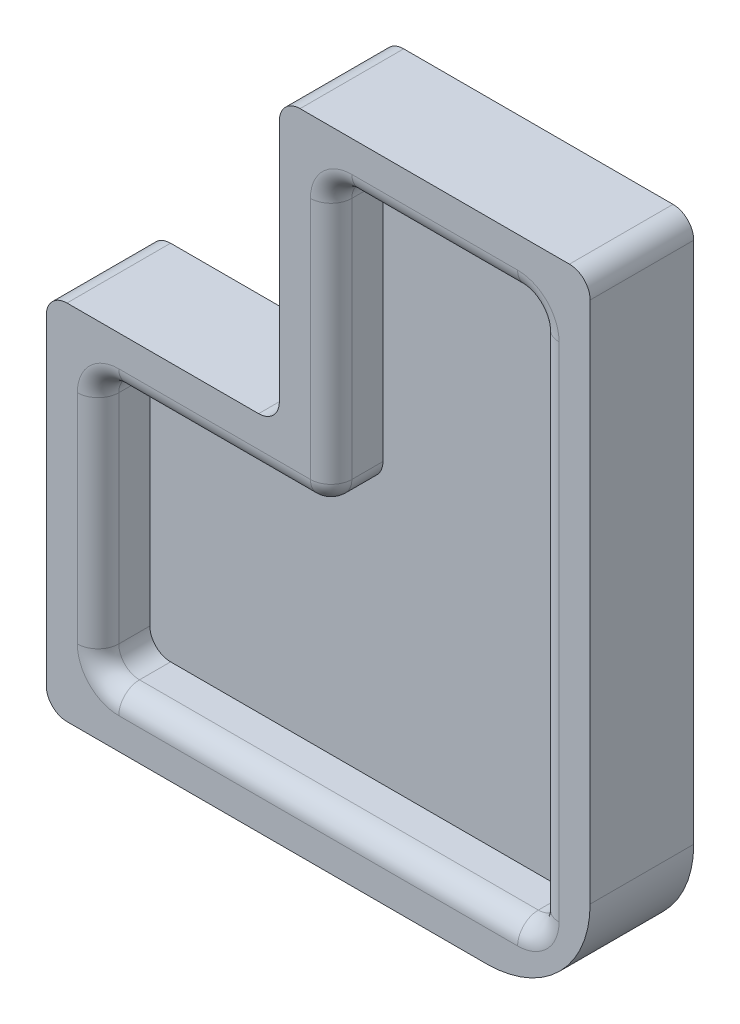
ISO-10303-21;
HEADER;
FILE_DESCRIPTION(('STEP AP214'),'2;1');
FILE_NAME('part.step','',(''),(''),'','','');
FILE_SCHEMA(('AUTOMOTIVE_DESIGN { 1 0 10303 214 1 1 1 1 }'));
ENDSEC;
DATA;
#1=APPLICATION_CONTEXT('core data for automotive mechanical design processes');
#2=APPLICATION_PROTOCOL_DEFINITION('international standard','automotive_design',2000,#1);
#3=PRODUCT_CONTEXT('',#1,'mechanical');
#4=PRODUCT('Part','Part','',(#3));
#5=PRODUCT_RELATED_PRODUCT_CATEGORY('part','',(#4));
#6=PRODUCT_DEFINITION_FORMATION('','',#4);
#7=PRODUCT_DEFINITION_CONTEXT('part definition',#1,'design');
#8=PRODUCT_DEFINITION('design','',#6,#7);
#9=PRODUCT_DEFINITION_SHAPE('','',#8);
#10=(LENGTH_UNIT() NAMED_UNIT(*) SI_UNIT(.MILLI.,.METRE.));
#11=(NAMED_UNIT(*) PLANE_ANGLE_UNIT() SI_UNIT($,.RADIAN.));
#12=(NAMED_UNIT(*) SI_UNIT($,.STERADIAN.) SOLID_ANGLE_UNIT());
#13=UNCERTAINTY_MEASURE_WITH_UNIT(LENGTH_MEASURE(1.E-05),#10,'distance_accuracy_value','');
#14=(GEOMETRIC_REPRESENTATION_CONTEXT(3) GLOBAL_UNCERTAINTY_ASSIGNED_CONTEXT((#13)) GLOBAL_UNIT_ASSIGNED_CONTEXT((#10,
#11,#12)) REPRESENTATION_CONTEXT('',''));
#15=CARTESIAN_POINT('',(0.,0.,0.));
#16=DIRECTION('',(0.,0.,1.));
#17=DIRECTION('',(1.,0.,0.));
#18=AXIS2_PLACEMENT_3D('',#15,#16,#17);
#19=CARTESIAN_POINT('',(91.,111.,16.));
#20=DIRECTION('',(0.,0.,-1.));
#21=DIRECTION('',(-1.,0.,0.));
#22=AXIS2_PLACEMENT_3D('',#19,#20,#21);
#23=TOROIDAL_SURFACE('',#22,8.,4.);
#24=CARTESIAN_POINT('',(99.,111.,16.));
#25=DIRECTION('',(0.,1.,0.));
#26=DIRECTION('',(0.,0.,1.));
#27=AXIS2_PLACEMENT_3D('',#24,#25,#26);
#28=CIRCLE('',#27,4.);
#29=CARTESIAN_POINT('',(95.,111.,16.));
#30=VERTEX_POINT('',#29);
#31=CARTESIAN_POINT('',(99.,111.,20.));
#32=VERTEX_POINT('',#31);
#33=EDGE_CURVE('E359',#30,#32,#28,.T.);
#34=ORIENTED_EDGE('',*,*,#33,.T.);
#35=CARTESIAN_POINT('',(91.,111.,20.));
#36=DIRECTION('',(0.,0.,-1.));
#37=DIRECTION('',(-1.,0.,0.));
#38=AXIS2_PLACEMENT_3D('',#35,#36,#37);
#39=CIRCLE('',#38,8.);
#40=CARTESIAN_POINT('',(91.,119.,20.));
#41=VERTEX_POINT('',#40);
#42=EDGE_CURVE('E356',#41,#32,#39,.T.);
#43=ORIENTED_EDGE('',*,*,#42,.F.);
#44=CARTESIAN_POINT('',(91.,119.,16.));
#45=DIRECTION('',(-1.,0.,0.));
#46=DIRECTION('',(0.,0.,1.));
#47=AXIS2_PLACEMENT_3D('',#44,#45,#46);
#48=CIRCLE('',#47,4.);
#49=CARTESIAN_POINT('',(91.,115.,16.));
#50=VERTEX_POINT('',#49);
#51=EDGE_CURVE('E362',#50,#41,#48,.T.);
#52=ORIENTED_EDGE('',*,*,#51,.F.);
#53=CARTESIAN_POINT('',(91.,111.,16.));
#54=DIRECTION('',(0.,0.,-1.));
#55=DIRECTION('',(-1.,0.,0.));
#56=AXIS2_PLACEMENT_3D('',#53,#54,#55);
#57=CIRCLE('',#56,4.);
#58=EDGE_CURVE('E353',#30,#50,#57,.F.);
#59=ORIENTED_EDGE('',*,*,#58,.F.);
#60=EDGE_LOOP('',(#34,#43,#52,#59));
#61=FACE_BOUND('',#60,.T.);
#62=ADVANCED_FACE('F35',(#61),#23,.T.);
#63=CARTESIAN_POINT('',(91.,14.,10.));
#64=DIRECTION('',(0.,0.,-1.));
#65=DIRECTION('',(-1.,0.,0.));
#66=AXIS2_PLACEMENT_3D('',#63,#64,#65);
#67=CYLINDRICAL_SURFACE('',#66,4.);
#68=DIRECTION('',(0.,0.,1.));
#69=VECTOR('',#68,1.);
#70=CARTESIAN_POINT('',(91.,10.,10.));
#71=LINE('',#70,#69);
#72=CARTESIAN_POINT('',(91.,10.,16.));
#73=VERTEX_POINT('',#72);
#74=CARTESIAN_POINT('',(91.,10.,10.));
#75=VERTEX_POINT('',#74);
#76=EDGE_CURVE('E306',#73,#75,#71,.F.);
#77=ORIENTED_EDGE('',*,*,#76,.F.);
#78=CARTESIAN_POINT('',(91.,14.,16.));
#79=DIRECTION('',(0.,0.,-1.));
#80=DIRECTION('',(-1.,0.,0.));
#81=AXIS2_PLACEMENT_3D('',#78,#79,#80);
#82=CIRCLE('',#81,4.);
#83=CARTESIAN_POINT('',(95.,14.,16.));
#84=VERTEX_POINT('',#83);
#85=EDGE_CURVE('E341',#73,#84,#82,.F.);
#86=ORIENTED_EDGE('',*,*,#85,.T.);
#87=DIRECTION('',(0.,0.,1.));
#88=VECTOR('',#87,1.);
#89=CARTESIAN_POINT('',(95.,14.,16.));
#90=LINE('',#89,#88);
#91=CARTESIAN_POINT('',(95.,14.,10.));
#92=VERTEX_POINT('',#91);
#93=EDGE_CURVE('E298',#92,#84,#90,.T.);
#94=ORIENTED_EDGE('',*,*,#93,.F.);
#95=CARTESIAN_POINT('',(91.,14.,10.));
#96=DIRECTION('',(0.,0.,1.));
#97=DIRECTION('',(1.,0.,0.));
#98=AXIS2_PLACEMENT_3D('',#95,#96,#97);
#99=CIRCLE('',#98,4.);
#100=EDGE_CURVE('E280',#75,#92,#99,.T.);
#101=ORIENTED_EDGE('',*,*,#100,.F.);
#102=EDGE_LOOP('',(#77,#86,#94,#101));
#103=FACE_BOUND('',#102,.T.);
#104=ADVANCED_FACE('F582',(#103),#67,.F.);
#105=CARTESIAN_POINT('',(10.,6.,16.));
#106=DIRECTION('',(1.,0.,0.));
#107=DIRECTION('',(0.,0.,-1.));
#108=AXIS2_PLACEMENT_3D('',#105,#106,#107);
#109=CYLINDRICAL_SURFACE('',#108,4.);
#110=DIRECTION('',(1.,0.,0.));
#111=VECTOR('',#110,1.);
#112=CARTESIAN_POINT('',(0.,6.,20.));
#113=LINE('',#112,#111);
#114=CARTESIAN_POINT('',(91.,6.,20.));
#115=VERTEX_POINT('',#114);
#116=CARTESIAN_POINT('',(14.,6.,20.));
#117=VERTEX_POINT('',#116);
#118=EDGE_CURVE('E241',#115,#117,#113,.F.);
#119=ORIENTED_EDGE('',*,*,#118,.F.);
#120=CARTESIAN_POINT('',(91.,6.,16.));
#121=DIRECTION('',(1.,0.,0.));
#122=DIRECTION('',(0.,0.,-1.));
#123=AXIS2_PLACEMENT_3D('',#120,#121,#122);
#124=CIRCLE('',#123,4.);
#125=EDGE_CURVE('E347',#73,#115,#124,.T.);
#126=ORIENTED_EDGE('',*,*,#125,.F.);
#127=DIRECTION('',(1.,0.,0.));
#128=VECTOR('',#127,1.);
#129=CARTESIAN_POINT('',(10.,10.,16.));
#130=LINE('',#129,#128);
#131=CARTESIAN_POINT('',(14.,10.,16.));
#132=VERTEX_POINT('',#131);
#133=EDGE_CURVE('E475',#132,#73,#130,.T.);
#134=ORIENTED_EDGE('',*,*,#133,.F.);
#135=CARTESIAN_POINT('',(14.,6.,16.));
#136=DIRECTION('',(1.,0.,0.));
#137=DIRECTION('',(0.,0.,-1.));
#138=AXIS2_PLACEMENT_3D('',#135,#136,#137);
#139=CIRCLE('',#138,4.);
#140=EDGE_CURVE('E338',#132,#117,#139,.T.);
#141=ORIENTED_EDGE('',*,*,#140,.T.);
#142=EDGE_LOOP('',(#119,#126,#134,#141));
#143=FACE_BOUND('',#142,.T.);
#144=ADVANCED_FACE('F495',(#143),#109,.T.);
#145=CARTESIAN_POINT('',(10.,10.,10.));
#146=DIRECTION('',(0.,-1.,0.));
#147=DIRECTION('',(0.,0.,-1.));
#148=AXIS2_PLACEMENT_3D('',#145,#146,#147);
#149=PLANE('',#148);
#150=ORIENTED_EDGE('',*,*,#133,.T.);
#151=ORIENTED_EDGE('',*,*,#76,.T.);
#152=DIRECTION('',(1.,0.,0.));
#153=VECTOR('',#152,1.);
#154=CARTESIAN_POINT('',(10.,10.,10.));
#155=LINE('',#154,#153);
#156=CARTESIAN_POINT('',(14.,10.,10.));
#157=VERTEX_POINT('',#156);
#158=EDGE_CURVE('E503',#157,#75,#155,.T.);
#159=ORIENTED_EDGE('',*,*,#158,.F.);
#160=DIRECTION('',(0.,0.,1.));
#161=VECTOR('',#160,1.);
#162=CARTESIAN_POINT('',(14.,10.,16.));
#163=LINE('',#162,#161);
#164=EDGE_CURVE('E303',#157,#132,#163,.T.);
#165=ORIENTED_EDGE('',*,*,#164,.T.);
#166=EDGE_LOOP('',(#150,#151,#159,#165));
#167=FACE_BOUND('',#166,.T.);
#168=ADVANCED_FACE('F501',(#167),#149,.F.);
#169=CARTESIAN_POINT('',(14.,14.,16.));
#170=DIRECTION('',(0.,0.,-1.));
#171=DIRECTION('',(-1.,0.,0.));
#172=AXIS2_PLACEMENT_3D('',#169,#170,#171);
#173=TOROIDAL_SURFACE('',#172,8.,4.);
#174=CARTESIAN_POINT('',(6.,14.,16.));
#175=DIRECTION('',(0.,-1.,0.));
#176=DIRECTION('',(0.,0.,-1.));
#177=AXIS2_PLACEMENT_3D('',#174,#175,#176);
#178=CIRCLE('',#177,4.);
#179=CARTESIAN_POINT('',(10.,14.,16.));
#180=VERTEX_POINT('',#179);
#181=CARTESIAN_POINT('',(6.,14.,20.));
#182=VERTEX_POINT('',#181);
#183=EDGE_CURVE('E335',#180,#182,#178,.T.);
#184=ORIENTED_EDGE('',*,*,#183,.T.);
#185=CARTESIAN_POINT('',(14.,14.,20.));
#186=DIRECTION('',(0.,0.,-1.));
#187=DIRECTION('',(-1.,0.,0.));
#188=AXIS2_PLACEMENT_3D('',#185,#186,#187);
#189=CIRCLE('',#188,8.);
#190=EDGE_CURVE('E332',#117,#182,#189,.T.);
#191=ORIENTED_EDGE('',*,*,#190,.F.);
#192=ORIENTED_EDGE('',*,*,#140,.F.);
#193=CARTESIAN_POINT('',(14.,14.,16.));
#194=DIRECTION('',(0.,0.,-1.));
#195=DIRECTION('',(-1.,0.,0.));
#196=AXIS2_PLACEMENT_3D('',#193,#194,#195);
#197=CIRCLE('',#196,4.);
#198=EDGE_CURVE('E329',#180,#132,#197,.F.);
#199=ORIENTED_EDGE('',*,*,#198,.F.);
#200=EDGE_LOOP('',(#184,#191,#192,#199));
#201=FACE_BOUND('',#200,.T.);
#202=ADVANCED_FACE('F493',(#201),#173,.T.);
#203=CARTESIAN_POINT('',(51.,115.,16.));
#204=DIRECTION('',(0.,-1.,0.));
#205=DIRECTION('',(0.,0.,-1.));
#206=AXIS2_PLACEMENT_3D('',#203,#204,#205);
#207=CYLINDRICAL_SURFACE('',#206,4.);
#208=DIRECTION('',(0.,-1.,0.));
#209=VECTOR('',#208,1.);
#210=CARTESIAN_POINT('',(55.,115.,16.));
#211=LINE('',#210,#209);
#212=CARTESIAN_POINT('',(55.,111.,16.));
#213=VERTEX_POINT('',#212);
#214=CARTESIAN_POINT('',(55.,64.,16.));
#215=VERTEX_POINT('',#214);
#216=EDGE_CURVE('E472',#213,#215,#211,.T.);
#217=ORIENTED_EDGE('',*,*,#216,.F.);
#218=CARTESIAN_POINT('',(51.,111.,16.));
#219=DIRECTION('',(0.,-1.,0.));
#220=DIRECTION('',(0.,0.,-1.));
#221=AXIS2_PLACEMENT_3D('',#218,#219,#220);
#222=CIRCLE('',#221,4.);
#223=CARTESIAN_POINT('',(51.,111.,20.));
#224=VERTEX_POINT('',#223);
#225=EDGE_CURVE('E260',#213,#224,#222,.T.);
#226=ORIENTED_EDGE('',*,*,#225,.T.);
#227=DIRECTION('',(0.,-1.,0.));
#228=VECTOR('',#227,1.);
#229=CARTESIAN_POINT('',(51.,0.,20.));
#230=LINE('',#229,#228);
#231=CARTESIAN_POINT('',(51.,64.,20.));
#232=VERTEX_POINT('',#231);
#233=EDGE_CURVE('E234',#232,#224,#230,.F.);
#234=ORIENTED_EDGE('',*,*,#233,.F.);
#235=CARTESIAN_POINT('',(51.,64.,16.));
#236=DIRECTION('',(0.,-1.,0.));
#237=DIRECTION('',(0.,0.,-1.));
#238=AXIS2_PLACEMENT_3D('',#235,#236,#237);
#239=CIRCLE('',#238,4.);
#240=EDGE_CURVE('E252',#232,#215,#239,.F.);
#241=ORIENTED_EDGE('',*,*,#240,.T.);
#242=EDGE_LOOP('',(#217,#226,#234,#241));
#243=FACE_BOUND('',#242,.T.);
#244=ADVANCED_FACE('F258',(#243),#207,.T.);
#245=CARTESIAN_POINT('',(59.,111.,10.));
#246=DIRECTION('',(0.,0.,-1.));
#247=DIRECTION('',(-1.,0.,0.));
#248=AXIS2_PLACEMENT_3D('',#245,#246,#247);
#249=CYLINDRICAL_SURFACE('',#248,4.);
#250=DIRECTION('',(0.,0.,1.));
#251=VECTOR('',#250,1.);
#252=CARTESIAN_POINT('',(59.,115.,10.));
#253=LINE('',#252,#251);
#254=CARTESIAN_POINT('',(59.,115.,16.));
#255=VERTEX_POINT('',#254);
#256=CARTESIAN_POINT('',(59.,115.,10.));
#257=VERTEX_POINT('',#256);
#258=EDGE_CURVE('E296',#255,#257,#253,.F.);
#259=ORIENTED_EDGE('',*,*,#258,.F.);
#260=CARTESIAN_POINT('',(59.,111.,16.));
#261=DIRECTION('',(0.,0.,-1.));
#262=DIRECTION('',(-1.,0.,0.));
#263=AXIS2_PLACEMENT_3D('',#260,#261,#262);
#264=CIRCLE('',#263,4.);
#265=EDGE_CURVE('E321',#255,#213,#264,.F.);
#266=ORIENTED_EDGE('',*,*,#265,.T.);
#267=DIRECTION('',(0.,0.,1.));
#268=VECTOR('',#267,1.);
#269=CARTESIAN_POINT('',(55.,111.,16.));
#270=LINE('',#269,#268);
#271=CARTESIAN_POINT('',(55.,111.,10.));
#272=VERTEX_POINT('',#271);
#273=EDGE_CURVE('E290',#272,#213,#270,.T.);
#274=ORIENTED_EDGE('',*,*,#273,.F.);
#275=CARTESIAN_POINT('',(59.,111.,10.));
#276=DIRECTION('',(0.,0.,1.));
#277=DIRECTION('',(1.,0.,0.));
#278=AXIS2_PLACEMENT_3D('',#275,#276,#277);
#279=CIRCLE('',#278,4.);
#280=EDGE_CURVE('E284',#257,#272,#279,.T.);
#281=ORIENTED_EDGE('',*,*,#280,.F.);
#282=EDGE_LOOP('',(#259,#266,#274,#281));
#283=FACE_BOUND('',#282,.T.);
#284=ADVANCED_FACE('F585',(#283),#249,.F.);
#285=CARTESIAN_POINT('',(55.,115.,10.));
#286=DIRECTION('',(-1.,0.,0.));
#287=DIRECTION('',(0.,0.,1.));
#288=AXIS2_PLACEMENT_3D('',#285,#286,#287);
#289=PLANE('',#288);
#290=ORIENTED_EDGE('',*,*,#273,.T.);
#291=ORIENTED_EDGE('',*,*,#216,.T.);
#292=DIRECTION('',(0.,0.,1.));
#293=VECTOR('',#292,1.);
#294=CARTESIAN_POINT('',(55.,64.,10.));
#295=LINE('',#294,#293);
#296=CARTESIAN_POINT('',(55.,64.,10.));
#297=VERTEX_POINT('',#296);
#298=EDGE_CURVE('E288',#215,#297,#295,.F.);
#299=ORIENTED_EDGE('',*,*,#298,.T.);
#300=DIRECTION('',(0.,-1.,0.));
#301=VECTOR('',#300,1.);
#302=CARTESIAN_POINT('',(55.,115.,10.));
#303=LINE('',#302,#301);
#304=EDGE_CURVE('E515',#272,#297,#303,.T.);
#305=ORIENTED_EDGE('',*,*,#304,.F.);
#306=EDGE_LOOP('',(#290,#291,#299,#305));
#307=FACE_BOUND('',#306,.T.);
#308=ADVANCED_FACE('F596',(#307),#289,.F.);
#309=CARTESIAN_POINT('',(14.,56.,16.));
#310=DIRECTION('',(0.,0.,-1.));
#311=DIRECTION('',(-1.,0.,0.));
#312=AXIS2_PLACEMENT_3D('',#309,#310,#311);
#313=TOROIDAL_SURFACE('',#312,8.,4.);
#314=CARTESIAN_POINT('',(14.,64.,16.));
#315=DIRECTION('',(-1.,0.,0.));
#316=DIRECTION('',(0.,0.,1.));
#317=AXIS2_PLACEMENT_3D('',#314,#315,#316);
#318=CIRCLE('',#317,4.);
#319=CARTESIAN_POINT('',(14.,60.,16.));
#320=VERTEX_POINT('',#319);
#321=CARTESIAN_POINT('',(14.,64.,20.));
#322=VERTEX_POINT('',#321);
#323=EDGE_CURVE('E315',#320,#322,#318,.T.);
#324=ORIENTED_EDGE('',*,*,#323,.T.);
#325=CARTESIAN_POINT('',(14.,56.,20.));
#326=DIRECTION('',(0.,0.,-1.));
#327=DIRECTION('',(-1.,0.,0.));
#328=AXIS2_PLACEMENT_3D('',#325,#326,#327);
#329=CIRCLE('',#328,8.);
#330=CARTESIAN_POINT('',(6.,56.,20.));
#331=VERTEX_POINT('',#330);
#332=EDGE_CURVE('E237',#331,#322,#329,.T.);
#333=ORIENTED_EDGE('',*,*,#332,.F.);
#334=CARTESIAN_POINT('',(6.,56.,16.));
#335=DIRECTION('',(0.,-1.,0.));
#336=DIRECTION('',(0.,0.,-1.));
#337=AXIS2_PLACEMENT_3D('',#334,#335,#336);
#338=CIRCLE('',#337,4.);
#339=CARTESIAN_POINT('',(10.,56.,16.));
#340=VERTEX_POINT('',#339);
#341=EDGE_CURVE('E318',#340,#331,#338,.T.);
#342=ORIENTED_EDGE('',*,*,#341,.F.);
#343=CARTESIAN_POINT('',(14.,56.,16.));
#344=DIRECTION('',(0.,0.,-1.));
#345=DIRECTION('',(-1.,0.,0.));
#346=AXIS2_PLACEMENT_3D('',#343,#344,#345);
#347=CIRCLE('',#346,4.);
#348=EDGE_CURVE('E313',#320,#340,#347,.F.);
#349=ORIENTED_EDGE('',*,*,#348,.F.);
#350=EDGE_LOOP('',(#324,#333,#342,#349));
#351=FACE_BOUND('',#350,.T.);
#352=ADVANCED_FACE('F613',(#351),#313,.T.);
#353=CARTESIAN_POINT('',(51.,64.,16.));
#354=DIRECTION('',(0.,0.,1.));
#355=DIRECTION('',(1.,0.,0.));
#356=AXIS2_PLACEMENT_3D('',#353,#354,#355);
#357=SPHERICAL_SURFACE('',#356,4.);
#358=ORIENTED_EDGE('',*,*,#240,.F.);
#359=CARTESIAN_POINT('',(51.,64.,16.));
#360=DIRECTION('',(-1.,0.,0.));
#361=DIRECTION('',(0.,0.,1.));
#362=AXIS2_PLACEMENT_3D('',#359,#360,#361);
#363=CIRCLE('',#362,4.);
#364=CARTESIAN_POINT('',(51.,60.,16.));
#365=VERTEX_POINT('',#364);
#366=EDGE_CURVE('E245',#365,#232,#363,.T.);
#367=ORIENTED_EDGE('',*,*,#366,.F.);
#368=CARTESIAN_POINT('',(51.,64.,16.));
#369=DIRECTION('',(0.,0.,1.));
#370=DIRECTION('',(1.,0.,0.));
#371=AXIS2_PLACEMENT_3D('',#368,#369,#370);
#372=CIRCLE('',#371,4.);
#373=EDGE_CURVE('E264',#365,#215,#372,.T.);
#374=ORIENTED_EDGE('',*,*,#373,.T.);
#375=EDGE_LOOP('',(#358,#367,#374));
#376=FACE_BOUND('',#375,.T.);
#377=ADVANCED_FACE('F263',(#376),#357,.T.);
#378=CARTESIAN_POINT('',(51.,64.,10.));
#379=DIRECTION('',(0.,0.,1.));
#380=DIRECTION('',(1.,0.,0.));
#381=AXIS2_PLACEMENT_3D('',#378,#379,#380);
#382=CYLINDRICAL_SURFACE('',#381,4.);
#383=CARTESIAN_POINT('',(51.,64.,10.));
#384=DIRECTION('',(0.,0.,1.));
#385=DIRECTION('',(1.,0.,0.));
#386=AXIS2_PLACEMENT_3D('',#383,#384,#385);
#387=CIRCLE('',#386,4.);
#388=CARTESIAN_POINT('',(51.,60.,10.));
#389=VERTEX_POINT('',#388);
#390=EDGE_CURVE('E308',#297,#389,#387,.F.);
#391=ORIENTED_EDGE('',*,*,#390,.F.);
#392=ORIENTED_EDGE('',*,*,#298,.F.);
#393=ORIENTED_EDGE('',*,*,#373,.F.);
#394=DIRECTION('',(0.,0.,1.));
#395=VECTOR('',#394,1.);
#396=CARTESIAN_POINT('',(51.,60.,10.));
#397=LINE('',#396,#395);
#398=EDGE_CURVE('E274',#389,#365,#397,.T.);
#399=ORIENTED_EDGE('',*,*,#398,.F.);
#400=EDGE_LOOP('',(#391,#392,#393,#399));
#401=FACE_BOUND('',#400,.T.);
#402=ADVANCED_FACE('F612',(#401),#382,.T.);
#403=CARTESIAN_POINT('',(0.,0.,10.));
#404=DIRECTION('',(0.,0.,1.));
#405=DIRECTION('',(1.,0.,0.));
#406=AXIS2_PLACEMENT_3D('',#403,#404,#405);
#407=PLANE('',#406);
#408=DIRECTION('',(-1.,0.,0.));
#409=VECTOR('',#408,1.);
#410=CARTESIAN_POINT('',(55.,60.,10.));
#411=LINE('',#410,#409);
#412=CARTESIAN_POINT('',(14.,60.,10.));
#413=VERTEX_POINT('',#412);
#414=EDGE_CURVE('E454',#389,#413,#411,.T.);
#415=ORIENTED_EDGE('',*,*,#414,.T.);
#416=CARTESIAN_POINT('',(14.,56.,10.));
#417=DIRECTION('',(0.,0.,1.));
#418=DIRECTION('',(1.,0.,0.));
#419=AXIS2_PLACEMENT_3D('',#416,#417,#418);
#420=CIRCLE('',#419,4.);
#421=CARTESIAN_POINT('',(10.,56.,10.));
#422=VERTEX_POINT('',#421);
#423=EDGE_CURVE('E286',#413,#422,#420,.T.);
#424=ORIENTED_EDGE('',*,*,#423,.T.);
#425=DIRECTION('',(0.,-1.,0.));
#426=VECTOR('',#425,1.);
#427=CARTESIAN_POINT('',(10.,60.,10.));
#428=LINE('',#427,#426);
#429=CARTESIAN_POINT('',(10.,14.,10.));
#430=VERTEX_POINT('',#429);
#431=EDGE_CURVE('E312',#422,#430,#428,.T.);
#432=ORIENTED_EDGE('',*,*,#431,.T.);
#433=CARTESIAN_POINT('',(14.,14.,10.));
#434=DIRECTION('',(0.,0.,1.));
#435=DIRECTION('',(1.,0.,0.));
#436=AXIS2_PLACEMENT_3D('',#433,#434,#435);
#437=CIRCLE('',#436,4.);
#438=EDGE_CURVE('E278',#430,#157,#437,.T.);
#439=ORIENTED_EDGE('',*,*,#438,.T.);
#440=ORIENTED_EDGE('',*,*,#158,.T.);
#441=ORIENTED_EDGE('',*,*,#100,.T.);
#442=DIRECTION('',(0.,1.,0.));
#443=VECTOR('',#442,1.);
#444=CARTESIAN_POINT('',(95.,10.,10.));
#445=LINE('',#444,#443);
#446=CARTESIAN_POINT('',(95.,111.,10.));
#447=VERTEX_POINT('',#446);
#448=EDGE_CURVE('E506',#92,#447,#445,.T.);
#449=ORIENTED_EDGE('',*,*,#448,.T.);
#450=CARTESIAN_POINT('',(91.,111.,10.));
#451=DIRECTION('',(0.,0.,1.));
#452=DIRECTION('',(1.,0.,0.));
#453=AXIS2_PLACEMENT_3D('',#450,#451,#452);
#454=CIRCLE('',#453,4.);
#455=CARTESIAN_POINT('',(91.,115.,10.));
#456=VERTEX_POINT('',#455);
#457=EDGE_CURVE('E282',#447,#456,#454,.T.);
#458=ORIENTED_EDGE('',*,*,#457,.T.);
#459=DIRECTION('',(-1.,0.,0.));
#460=VECTOR('',#459,1.);
#461=CARTESIAN_POINT('',(95.,115.,10.));
#462=LINE('',#461,#460);
#463=EDGE_CURVE('E509',#456,#257,#462,.T.);
#464=ORIENTED_EDGE('',*,*,#463,.T.);
#465=ORIENTED_EDGE('',*,*,#280,.T.);
#466=ORIENTED_EDGE('',*,*,#304,.T.);
#467=ORIENTED_EDGE('',*,*,#390,.T.);
#468=EDGE_LOOP('',(#415,#424,#432,#439,#440,#441,#449,#458,#464,#465,#466,#467));
#469=FACE_BOUND('',#468,.T.);
#470=ADVANCED_FACE('F616',(#469),#407,.T.);
#471=CARTESIAN_POINT('',(0.,0.,0.));
#472=DIRECTION('',(0.,0.,-1.));
#473=DIRECTION('',(-1.,0.,0.));
#474=AXIS2_PLACEMENT_3D('',#471,#472,#473);
#475=PLANE('',#474);
#476=DIRECTION('',(-1.,0.,0.));
#477=VECTOR('',#476,1.);
#478=CARTESIAN_POINT('',(45.,125.,0.));
#479=LINE('',#478,#477);
#480=CARTESIAN_POINT('',(101.,125.,0.));
#481=VERTEX_POINT('',#480);
#482=CARTESIAN_POINT('',(49.,125.,0.));
#483=VERTEX_POINT('',#482);
#484=EDGE_CURVE('E432',#481,#483,#479,.T.);
#485=ORIENTED_EDGE('',*,*,#484,.F.);
#486=CARTESIAN_POINT('',(101.,121.,0.));
#487=DIRECTION('',(0.,0.,-1.));
#488=DIRECTION('',(-1.,0.,0.));
#489=AXIS2_PLACEMENT_3D('',#486,#487,#488);
#490=CIRCLE('',#489,4.);
#491=CARTESIAN_POINT('',(105.,121.,0.));
#492=VERTEX_POINT('',#491);
#493=EDGE_CURVE('E388',#481,#492,#490,.T.);
#494=ORIENTED_EDGE('',*,*,#493,.T.);
#495=DIRECTION('',(0.,1.,0.));
#496=VECTOR('',#495,1.);
#497=CARTESIAN_POINT('',(105.,125.,0.));
#498=LINE('',#497,#496);
#499=CARTESIAN_POINT('',(105.,20.,0.));
#500=VERTEX_POINT('',#499);
#501=EDGE_CURVE('E453',#500,#492,#498,.T.);
#502=ORIENTED_EDGE('',*,*,#501,.F.);
#503=CARTESIAN_POINT('',(85.,20.,0.));
#504=DIRECTION('',(0.,0.,-1.));
#505=DIRECTION('',(-1.,0.,0.));
#506=AXIS2_PLACEMENT_3D('',#503,#504,#505);
#507=CIRCLE('',#506,20.);
#508=CARTESIAN_POINT('',(85.,0.,0.));
#509=VERTEX_POINT('',#508);
#510=EDGE_CURVE('E369',#500,#509,#507,.T.);
#511=ORIENTED_EDGE('',*,*,#510,.T.);
#512=DIRECTION('',(1.,0.,0.));
#513=VECTOR('',#512,1.);
#514=CARTESIAN_POINT('',(105.,0.,0.));
#515=LINE('',#514,#513);
#516=CARTESIAN_POINT('',(4.,0.,0.));
#517=VERTEX_POINT('',#516);
#518=EDGE_CURVE('E451',#517,#509,#515,.T.);
#519=ORIENTED_EDGE('',*,*,#518,.F.);
#520=CARTESIAN_POINT('',(4.,4.,0.));
#521=DIRECTION('',(0.,0.,-1.));
#522=DIRECTION('',(-1.,0.,0.));
#523=AXIS2_PLACEMENT_3D('',#520,#521,#522);
#524=CIRCLE('',#523,4.);
#525=CARTESIAN_POINT('',(0.,4.,0.));
#526=VERTEX_POINT('',#525);
#527=EDGE_CURVE('E382',#517,#526,#524,.T.);
#528=ORIENTED_EDGE('',*,*,#527,.T.);
#529=DIRECTION('',(0.,-1.,0.));
#530=VECTOR('',#529,1.);
#531=CARTESIAN_POINT('',(0.,0.,0.));
#532=LINE('',#531,#530);
#533=CARTESIAN_POINT('',(0.,66.,0.));
#534=VERTEX_POINT('',#533);
#535=EDGE_CURVE('E460',#534,#526,#532,.T.);
#536=ORIENTED_EDGE('',*,*,#535,.F.);
#537=CARTESIAN_POINT('',(4.,66.,0.));
#538=DIRECTION('',(0.,0.,-1.));
#539=DIRECTION('',(-1.,0.,0.));
#540=AXIS2_PLACEMENT_3D('',#537,#538,#539);
#541=CIRCLE('',#540,4.);
#542=CARTESIAN_POINT('',(4.,70.,0.));
#543=VERTEX_POINT('',#542);
#544=EDGE_CURVE('E386',#534,#543,#541,.T.);
#545=ORIENTED_EDGE('',*,*,#544,.T.);
#546=DIRECTION('',(-1.,0.,0.));
#547=VECTOR('',#546,1.);
#548=CARTESIAN_POINT('',(0.,70.,0.));
#549=LINE('',#548,#547);
#550=CARTESIAN_POINT('',(41.,70.,0.));
#551=VERTEX_POINT('',#550);
#552=EDGE_CURVE('E423',#551,#543,#549,.T.);
#553=ORIENTED_EDGE('',*,*,#552,.F.);
#554=CARTESIAN_POINT('',(41.,74.,0.));
#555=DIRECTION('',(0.,0.,-1.));
#556=DIRECTION('',(-1.,0.,0.));
#557=AXIS2_PLACEMENT_3D('',#554,#555,#556);
#558=CIRCLE('',#557,4.);
#559=CARTESIAN_POINT('',(45.,74.,0.));
#560=VERTEX_POINT('',#559);
#561=EDGE_CURVE('E43',#551,#560,#558,.F.);
#562=ORIENTED_EDGE('',*,*,#561,.T.);
#563=DIRECTION('',(0.,-1.,0.));
#564=VECTOR('',#563,1.);
#565=CARTESIAN_POINT('',(45.,70.,0.));
#566=LINE('',#565,#564);
#567=CARTESIAN_POINT('',(45.,121.,0.));
#568=VERTEX_POINT('',#567);
#569=EDGE_CURVE('E421',#568,#560,#566,.T.);
#570=ORIENTED_EDGE('',*,*,#569,.F.);
#571=CARTESIAN_POINT('',(49.,121.,0.));
#572=DIRECTION('',(0.,0.,-1.));
#573=DIRECTION('',(-1.,0.,0.));
#574=AXIS2_PLACEMENT_3D('',#571,#572,#573);
#575=CIRCLE('',#574,4.);
#576=EDGE_CURVE('E384',#568,#483,#575,.T.);
#577=ORIENTED_EDGE('',*,*,#576,.T.);
#578=EDGE_LOOP('',(#485,#494,#502,#511,#519,#528,#536,#545,#553,#562,#570,#577));
#579=FACE_BOUND('',#578,.T.);
#580=ADVANCED_FACE('F420',(#579),#475,.T.);
#581=CARTESIAN_POINT('',(0.,0.,20.));
#582=DIRECTION('',(1.,0.,0.));
#583=DIRECTION('',(0.,0.,-1.));
#584=AXIS2_PLACEMENT_3D('',#581,#582,#583);
#585=PLANE('',#584);
#586=DIRECTION('',(0.,-1.,0.));
#587=VECTOR('',#586,1.);
#588=CARTESIAN_POINT('',(0.,0.,20.));
#589=LINE('',#588,#587);
#590=CARTESIAN_POINT('',(0.,66.,20.));
#591=VERTEX_POINT('',#590);
#592=CARTESIAN_POINT('',(0.,4.,20.));
#593=VERTEX_POINT('',#592);
#594=EDGE_CURVE('E443',#591,#593,#589,.T.);
#595=ORIENTED_EDGE('',*,*,#594,.F.);
#596=DIRECTION('',(0.,0.,-1.));
#597=VECTOR('',#596,1.);
#598=CARTESIAN_POINT('',(0.,66.,20.));
#599=LINE('',#598,#597);
#600=EDGE_CURVE('E400',#591,#534,#599,.T.);
#601=ORIENTED_EDGE('',*,*,#600,.T.);
#602=ORIENTED_EDGE('',*,*,#535,.T.);
#603=DIRECTION('',(0.,0.,-1.));
#604=VECTOR('',#603,1.);
#605=CARTESIAN_POINT('',(0.,4.,20.));
#606=LINE('',#605,#604);
#607=EDGE_CURVE('E50',#526,#593,#606,.F.);
#608=ORIENTED_EDGE('',*,*,#607,.T.);
#609=EDGE_LOOP('',(#595,#601,#602,#608));
#610=FACE_BOUND('',#609,.T.);
#611=ADVANCED_FACE('F553',(#610),#585,.F.);
#612=CARTESIAN_POINT('',(0.,70.,20.));
#613=DIRECTION('',(0.,-1.,0.));
#614=DIRECTION('',(0.,0.,-1.));
#615=AXIS2_PLACEMENT_3D('',#612,#613,#614);
#616=PLANE('',#615);
#617=ORIENTED_EDGE('',*,*,#552,.T.);
#618=DIRECTION('',(0.,0.,-1.));
#619=VECTOR('',#618,1.);
#620=CARTESIAN_POINT('',(4.,70.,20.));
#621=LINE('',#620,#619);
#622=CARTESIAN_POINT('',(4.,70.,20.));
#623=VERTEX_POINT('',#622);
#624=EDGE_CURVE('E406',#543,#623,#621,.F.);
#625=ORIENTED_EDGE('',*,*,#624,.T.);
#626=DIRECTION('',(-1.,0.,0.));
#627=VECTOR('',#626,1.);
#628=CARTESIAN_POINT('',(0.,70.,20.));
#629=LINE('',#628,#627);
#630=CARTESIAN_POINT('',(41.,70.,20.));
#631=VERTEX_POINT('',#630);
#632=EDGE_CURVE('E438',#631,#623,#629,.T.);
#633=ORIENTED_EDGE('',*,*,#632,.F.);
#634=DIRECTION('',(0.,0.,-1.));
#635=VECTOR('',#634,1.);
#636=CARTESIAN_POINT('',(41.,70.,0.));
#637=LINE('',#636,#635);
#638=EDGE_CURVE('E403',#631,#551,#637,.T.);
#639=ORIENTED_EDGE('',*,*,#638,.T.);
#640=EDGE_LOOP('',(#617,#625,#633,#639));
#641=FACE_BOUND('',#640,.T.);
#642=ADVANCED_FACE('F441',(#641),#616,.F.);
#643=CARTESIAN_POINT('',(45.,70.,20.));
#644=DIRECTION('',(1.,0.,0.));
#645=DIRECTION('',(0.,0.,-1.));
#646=AXIS2_PLACEMENT_3D('',#643,#644,#645);
#647=PLANE('',#646);
#648=DIRECTION('',(0.,-1.,0.));
#649=VECTOR('',#648,1.);
#650=CARTESIAN_POINT('',(45.,70.,20.));
#651=LINE('',#650,#649);
#652=CARTESIAN_POINT('',(45.,121.,20.));
#653=VERTEX_POINT('',#652);
#654=CARTESIAN_POINT('',(45.,74.,20.));
#655=VERTEX_POINT('',#654);
#656=EDGE_CURVE('E439',#653,#655,#651,.T.);
#657=ORIENTED_EDGE('',*,*,#656,.F.);
#658=DIRECTION('',(0.,0.,-1.));
#659=VECTOR('',#658,1.);
#660=CARTESIAN_POINT('',(45.,121.,20.));
#661=LINE('',#660,#659);
#662=EDGE_CURVE('E410',#653,#568,#661,.T.);
#663=ORIENTED_EDGE('',*,*,#662,.T.);
#664=ORIENTED_EDGE('',*,*,#569,.T.);
#665=DIRECTION('',(0.,0.,-1.));
#666=VECTOR('',#665,1.);
#667=CARTESIAN_POINT('',(45.,74.,20.));
#668=LINE('',#667,#666);
#669=EDGE_CURVE('E408',#560,#655,#668,.F.);
#670=ORIENTED_EDGE('',*,*,#669,.T.);
#671=EDGE_LOOP('',(#657,#663,#664,#670));
#672=FACE_BOUND('',#671,.T.);
#673=ADVANCED_FACE('F429',(#672),#647,.F.);
#674=CARTESIAN_POINT('',(45.,125.,20.));
#675=DIRECTION('',(0.,-1.,0.));
#676=DIRECTION('',(0.,0.,-1.));
#677=AXIS2_PLACEMENT_3D('',#674,#675,#676);
#678=PLANE('',#677);
#679=DIRECTION('',(-1.,0.,0.));
#680=VECTOR('',#679,1.);
#681=CARTESIAN_POINT('',(45.,125.,20.));
#682=LINE('',#681,#680);
#683=CARTESIAN_POINT('',(101.,125.,20.));
#684=VERTEX_POINT('',#683);
#685=CARTESIAN_POINT('',(49.,125.,20.));
#686=VERTEX_POINT('',#685);
#687=EDGE_CURVE('E447',#684,#686,#682,.T.);
#688=ORIENTED_EDGE('',*,*,#687,.F.);
#689=DIRECTION('',(0.,0.,-1.));
#690=VECTOR('',#689,1.);
#691=CARTESIAN_POINT('',(101.,125.,20.));
#692=LINE('',#691,#690);
#693=EDGE_CURVE('E379',#684,#481,#692,.T.);
#694=ORIENTED_EDGE('',*,*,#693,.T.);
#695=ORIENTED_EDGE('',*,*,#484,.T.);
#696=DIRECTION('',(0.,0.,-1.));
#697=VECTOR('',#696,1.);
#698=CARTESIAN_POINT('',(49.,125.,20.));
#699=LINE('',#698,#697);
#700=EDGE_CURVE('E377',#483,#686,#699,.F.);
#701=ORIENTED_EDGE('',*,*,#700,.T.);
#702=EDGE_LOOP('',(#688,#694,#695,#701));
#703=FACE_BOUND('',#702,.T.);
#704=ADVANCED_FACE('F531',(#703),#678,.F.);
#705=CARTESIAN_POINT('',(105.,125.,20.));
#706=DIRECTION('',(-1.,0.,0.));
#707=DIRECTION('',(0.,0.,1.));
#708=AXIS2_PLACEMENT_3D('',#705,#706,#707);
#709=PLANE('',#708);
#710=ORIENTED_EDGE('',*,*,#501,.T.);
#711=DIRECTION('',(0.,0.,-1.));
#712=VECTOR('',#711,1.);
#713=CARTESIAN_POINT('',(105.,121.,20.));
#714=LINE('',#713,#712);
#715=CARTESIAN_POINT('',(105.,121.,20.));
#716=VERTEX_POINT('',#715);
#717=EDGE_CURVE('E390',#492,#716,#714,.F.);
#718=ORIENTED_EDGE('',*,*,#717,.T.);
#719=DIRECTION('',(0.,1.,0.));
#720=VECTOR('',#719,1.);
#721=CARTESIAN_POINT('',(105.,125.,20.));
#722=LINE('',#721,#720);
#723=CARTESIAN_POINT('',(105.,20.,20.));
#724=VERTEX_POINT('',#723);
#725=EDGE_CURVE('E521',#724,#716,#722,.T.);
#726=ORIENTED_EDGE('',*,*,#725,.F.);
#727=DIRECTION('',(0.,0.,-1.));
#728=VECTOR('',#727,1.);
#729=CARTESIAN_POINT('',(105.,20.,20.));
#730=LINE('',#729,#728);
#731=EDGE_CURVE('E310',#724,#500,#730,.T.);
#732=ORIENTED_EDGE('',*,*,#731,.T.);
#733=EDGE_LOOP('',(#710,#718,#726,#732));
#734=FACE_BOUND('',#733,.T.);
#735=ADVANCED_FACE('F537',(#734),#709,.F.);
#736=CARTESIAN_POINT('',(105.,0.,20.));
#737=DIRECTION('',(0.,1.,0.));
#738=DIRECTION('',(0.,0.,1.));
#739=AXIS2_PLACEMENT_3D('',#736,#737,#738);
#740=PLANE('',#739);
#741=DIRECTION('',(1.,0.,0.));
#742=VECTOR('',#741,1.);
#743=CARTESIAN_POINT('',(105.,0.,20.));
#744=LINE('',#743,#742);
#745=CARTESIAN_POINT('',(4.,0.,20.));
#746=VERTEX_POINT('',#745);
#747=CARTESIAN_POINT('',(85.,0.,20.));
#748=VERTEX_POINT('',#747);
#749=EDGE_CURVE('E462',#746,#748,#744,.T.);
#750=ORIENTED_EDGE('',*,*,#749,.F.);
#751=DIRECTION('',(0.,0.,-1.));
#752=VECTOR('',#751,1.);
#753=CARTESIAN_POINT('',(4.,0.,20.));
#754=LINE('',#753,#752);
#755=EDGE_CURVE('E413',#746,#517,#754,.T.);
#756=ORIENTED_EDGE('',*,*,#755,.T.);
#757=ORIENTED_EDGE('',*,*,#518,.T.);
#758=DIRECTION('',(0.,0.,-1.));
#759=VECTOR('',#758,1.);
#760=CARTESIAN_POINT('',(85.,0.,20.));
#761=LINE('',#760,#759);
#762=EDGE_CURVE('E372',#509,#748,#761,.F.);
#763=ORIENTED_EDGE('',*,*,#762,.T.);
#764=EDGE_LOOP('',(#750,#756,#757,#763));
#765=FACE_BOUND('',#764,.T.);
#766=ADVANCED_FACE('F548',(#765),#740,.F.);
#767=CARTESIAN_POINT('',(55.,60.,10.));
#768=DIRECTION('',(0.,1.,0.));
#769=DIRECTION('',(0.,0.,1.));
#770=AXIS2_PLACEMENT_3D('',#767,#768,#769);
#771=PLANE('',#770);
#772=DIRECTION('',(-1.,0.,0.));
#773=VECTOR('',#772,1.);
#774=CARTESIAN_POINT('',(55.,60.,16.));
#775=LINE('',#774,#773);
#776=EDGE_CURVE('E247',#365,#320,#775,.T.);
#777=ORIENTED_EDGE('',*,*,#776,.T.);
#778=DIRECTION('',(0.,0.,1.));
#779=VECTOR('',#778,1.);
#780=CARTESIAN_POINT('',(14.,60.,10.));
#781=LINE('',#780,#779);
#782=EDGE_CURVE('E276',#320,#413,#781,.F.);
#783=ORIENTED_EDGE('',*,*,#782,.T.);
#784=ORIENTED_EDGE('',*,*,#414,.F.);
#785=ORIENTED_EDGE('',*,*,#398,.T.);
#786=EDGE_LOOP('',(#777,#783,#784,#785));
#787=FACE_BOUND('',#786,.T.);
#788=ADVANCED_FACE('F591',(#787),#771,.F.);
#789=CARTESIAN_POINT('',(55.,64.,16.));
#790=DIRECTION('',(-1.,0.,0.));
#791=DIRECTION('',(0.,0.,1.));
#792=AXIS2_PLACEMENT_3D('',#789,#790,#791);
#793=CYLINDRICAL_SURFACE('',#792,4.);
#794=DIRECTION('',(-1.,0.,0.));
#795=VECTOR('',#794,1.);
#796=CARTESIAN_POINT('',(0.,64.,20.));
#797=LINE('',#796,#795);
#798=EDGE_CURVE('E229',#322,#232,#797,.F.);
#799=ORIENTED_EDGE('',*,*,#798,.F.);
#800=ORIENTED_EDGE('',*,*,#323,.F.);
#801=ORIENTED_EDGE('',*,*,#776,.F.);
#802=ORIENTED_EDGE('',*,*,#366,.T.);
#803=EDGE_LOOP('',(#799,#800,#801,#802));
#804=FACE_BOUND('',#803,.T.);
#805=ADVANCED_FACE('F246',(#804),#793,.T.);
#806=CARTESIAN_POINT('',(14.,56.,10.));
#807=DIRECTION('',(0.,0.,-1.));
#808=DIRECTION('',(-1.,0.,0.));
#809=AXIS2_PLACEMENT_3D('',#806,#807,#808);
#810=CYLINDRICAL_SURFACE('',#809,4.);
#811=ORIENTED_EDGE('',*,*,#782,.F.);
#812=ORIENTED_EDGE('',*,*,#348,.T.);
#813=DIRECTION('',(0.,0.,1.));
#814=VECTOR('',#813,1.);
#815=CARTESIAN_POINT('',(10.,56.,16.));
#816=LINE('',#815,#814);
#817=EDGE_CURVE('E268',#422,#340,#816,.T.);
#818=ORIENTED_EDGE('',*,*,#817,.F.);
#819=ORIENTED_EDGE('',*,*,#423,.F.);
#820=EDGE_LOOP('',(#811,#812,#818,#819));
#821=FACE_BOUND('',#820,.T.);
#822=ADVANCED_FACE('F590',(#821),#810,.F.);
#823=CARTESIAN_POINT('',(59.,111.,16.));
#824=DIRECTION('',(0.,0.,-1.));
#825=DIRECTION('',(-1.,0.,0.));
#826=AXIS2_PLACEMENT_3D('',#823,#824,#825);
#827=TOROIDAL_SURFACE('',#826,8.,4.);
#828=CARTESIAN_POINT('',(59.,119.,16.));
#829=DIRECTION('',(-1.,0.,0.));
#830=DIRECTION('',(0.,0.,1.));
#831=AXIS2_PLACEMENT_3D('',#828,#829,#830);
#832=CIRCLE('',#831,4.);
#833=CARTESIAN_POINT('',(59.,119.,20.));
#834=VERTEX_POINT('',#833);
#835=EDGE_CURVE('E325',#255,#834,#832,.T.);
#836=ORIENTED_EDGE('',*,*,#835,.T.);
#837=CARTESIAN_POINT('',(59.,111.,20.));
#838=DIRECTION('',(0.,0.,-1.));
#839=DIRECTION('',(-1.,0.,0.));
#840=AXIS2_PLACEMENT_3D('',#837,#838,#839);
#841=CIRCLE('',#840,8.);
#842=EDGE_CURVE('E323',#224,#834,#841,.T.);
#843=ORIENTED_EDGE('',*,*,#842,.F.);
#844=ORIENTED_EDGE('',*,*,#225,.F.);
#845=ORIENTED_EDGE('',*,*,#265,.F.);
#846=EDGE_LOOP('',(#836,#843,#844,#845));
#847=FACE_BOUND('',#846,.T.);
#848=ADVANCED_FACE('F594',(#847),#827,.T.);
#849=CARTESIAN_POINT('',(10.,60.,10.));
#850=DIRECTION('',(-1.,0.,0.));
#851=DIRECTION('',(0.,0.,1.));
#852=AXIS2_PLACEMENT_3D('',#849,#850,#851);
#853=PLANE('',#852);
#854=DIRECTION('',(0.,-1.,0.));
#855=VECTOR('',#854,1.);
#856=CARTESIAN_POINT('',(10.,60.,16.));
#857=LINE('',#856,#855);
#858=EDGE_CURVE('E253',#340,#180,#857,.T.);
#859=ORIENTED_EDGE('',*,*,#858,.T.);
#860=DIRECTION('',(0.,0.,1.));
#861=VECTOR('',#860,1.);
#862=CARTESIAN_POINT('',(10.,14.,10.));
#863=LINE('',#862,#861);
#864=EDGE_CURVE('E266',#180,#430,#863,.F.);
#865=ORIENTED_EDGE('',*,*,#864,.T.);
#866=ORIENTED_EDGE('',*,*,#431,.F.);
#867=ORIENTED_EDGE('',*,*,#817,.T.);
#868=EDGE_LOOP('',(#859,#865,#866,#867));
#869=FACE_BOUND('',#868,.T.);
#870=ADVANCED_FACE('F478',(#869),#853,.F.);
#871=CARTESIAN_POINT('',(6.,60.,16.));
#872=DIRECTION('',(0.,-1.,0.));
#873=DIRECTION('',(0.,0.,-1.));
#874=AXIS2_PLACEMENT_3D('',#871,#872,#873);
#875=CYLINDRICAL_SURFACE('',#874,4.);
#876=DIRECTION('',(0.,-1.,0.));
#877=VECTOR('',#876,1.);
#878=CARTESIAN_POINT('',(6.,0.,20.));
#879=LINE('',#878,#877);
#880=EDGE_CURVE('E464',#182,#331,#879,.F.);
#881=ORIENTED_EDGE('',*,*,#880,.F.);
#882=ORIENTED_EDGE('',*,*,#183,.F.);
#883=ORIENTED_EDGE('',*,*,#858,.F.);
#884=ORIENTED_EDGE('',*,*,#341,.T.);
#885=EDGE_LOOP('',(#881,#882,#883,#884));
#886=FACE_BOUND('',#885,.T.);
#887=ADVANCED_FACE('F490',(#886),#875,.T.);
#888=CARTESIAN_POINT('',(14.,14.,10.));
#889=DIRECTION('',(0.,0.,-1.));
#890=DIRECTION('',(-1.,0.,0.));
#891=AXIS2_PLACEMENT_3D('',#888,#889,#890);
#892=CYLINDRICAL_SURFACE('',#891,4.);
#893=ORIENTED_EDGE('',*,*,#864,.F.);
#894=ORIENTED_EDGE('',*,*,#198,.T.);
#895=ORIENTED_EDGE('',*,*,#164,.F.);
#896=ORIENTED_EDGE('',*,*,#438,.F.);
#897=EDGE_LOOP('',(#893,#894,#895,#896));
#898=FACE_BOUND('',#897,.T.);
#899=ADVANCED_FACE('F486',(#898),#892,.F.);
#900=CARTESIAN_POINT('',(91.,14.,16.));
#901=DIRECTION('',(0.,0.,-1.));
#902=DIRECTION('',(-1.,0.,0.));
#903=AXIS2_PLACEMENT_3D('',#900,#901,#902);
#904=TOROIDAL_SURFACE('',#903,8.,4.);
#905=ORIENTED_EDGE('',*,*,#125,.T.);
#906=CARTESIAN_POINT('',(91.,14.,20.));
#907=DIRECTION('',(0.,0.,-1.));
#908=DIRECTION('',(-1.,0.,0.));
#909=AXIS2_PLACEMENT_3D('',#906,#907,#908);
#910=CIRCLE('',#909,8.);
#911=CARTESIAN_POINT('',(99.,14.,20.));
#912=VERTEX_POINT('',#911);
#913=EDGE_CURVE('E344',#912,#115,#910,.T.);
#914=ORIENTED_EDGE('',*,*,#913,.F.);
#915=CARTESIAN_POINT('',(99.,14.,16.));
#916=DIRECTION('',(0.,1.,0.));
#917=DIRECTION('',(0.,0.,1.));
#918=AXIS2_PLACEMENT_3D('',#915,#916,#917);
#919=CIRCLE('',#918,4.);
#920=EDGE_CURVE('E350',#84,#912,#919,.T.);
#921=ORIENTED_EDGE('',*,*,#920,.F.);
#922=ORIENTED_EDGE('',*,*,#85,.F.);
#923=EDGE_LOOP('',(#905,#914,#921,#922));
#924=FACE_BOUND('',#923,.T.);
#925=ADVANCED_FACE('F609',(#924),#904,.T.);
#926=CARTESIAN_POINT('',(0.,0.,20.));
#927=DIRECTION('',(0.,0.,-1.));
#928=DIRECTION('',(-1.,0.,0.));
#929=AXIS2_PLACEMENT_3D('',#926,#927,#928);
#930=PLANE('',#929);
#931=ORIENTED_EDGE('',*,*,#725,.T.);
#932=CARTESIAN_POINT('',(101.,121.,20.));
#933=DIRECTION('',(0.,0.,-1.));
#934=DIRECTION('',(-1.,0.,0.));
#935=AXIS2_PLACEMENT_3D('',#932,#933,#934);
#936=CIRCLE('',#935,4.);
#937=EDGE_CURVE('E397',#716,#684,#936,.F.);
#938=ORIENTED_EDGE('',*,*,#937,.T.);
#939=ORIENTED_EDGE('',*,*,#687,.T.);
#940=CARTESIAN_POINT('',(49.,121.,20.));
#941=DIRECTION('',(0.,0.,-1.));
#942=DIRECTION('',(-1.,0.,0.));
#943=AXIS2_PLACEMENT_3D('',#940,#941,#942);
#944=CIRCLE('',#943,4.);
#945=EDGE_CURVE('E394',#686,#653,#944,.F.);
#946=ORIENTED_EDGE('',*,*,#945,.T.);
#947=ORIENTED_EDGE('',*,*,#656,.T.);
#948=CARTESIAN_POINT('',(41.,74.,20.));
#949=DIRECTION('',(0.,0.,-1.));
#950=DIRECTION('',(-1.,0.,0.));
#951=AXIS2_PLACEMENT_3D('',#948,#949,#950);
#952=CIRCLE('',#951,4.);
#953=EDGE_CURVE('E11',#655,#631,#952,.T.);
#954=ORIENTED_EDGE('',*,*,#953,.T.);
#955=ORIENTED_EDGE('',*,*,#632,.T.);
#956=CARTESIAN_POINT('',(4.,66.,20.));
#957=DIRECTION('',(0.,0.,-1.));
#958=DIRECTION('',(-1.,0.,0.));
#959=AXIS2_PLACEMENT_3D('',#956,#957,#958);
#960=CIRCLE('',#959,4.);
#961=EDGE_CURVE('E57',#623,#591,#960,.F.);
#962=ORIENTED_EDGE('',*,*,#961,.T.);
#963=ORIENTED_EDGE('',*,*,#594,.T.);
#964=CARTESIAN_POINT('',(4.,4.,20.));
#965=DIRECTION('',(0.,0.,-1.));
#966=DIRECTION('',(-1.,0.,0.));
#967=AXIS2_PLACEMENT_3D('',#964,#965,#966);
#968=CIRCLE('',#967,4.);
#969=EDGE_CURVE('E392',#593,#746,#968,.F.);
#970=ORIENTED_EDGE('',*,*,#969,.T.);
#971=ORIENTED_EDGE('',*,*,#749,.T.);
#972=CARTESIAN_POINT('',(85.,20.,20.));
#973=DIRECTION('',(0.,0.,-1.));
#974=DIRECTION('',(-1.,0.,0.));
#975=AXIS2_PLACEMENT_3D('',#972,#973,#974);
#976=CIRCLE('',#975,20.);
#977=EDGE_CURVE('E375',#748,#724,#976,.F.);
#978=ORIENTED_EDGE('',*,*,#977,.T.);
#979=EDGE_LOOP('',(#931,#938,#939,#946,#947,#954,#955,#962,#963,#970,#971,#978));
#980=FACE_BOUND('',#979,.T.);
#981=DIRECTION('',(-1.,0.,0.));
#982=VECTOR('',#981,1.);
#983=CARTESIAN_POINT('',(0.,119.,20.));
#984=LINE('',#983,#982);
#985=EDGE_CURVE('E261',#834,#41,#984,.F.);
#986=ORIENTED_EDGE('',*,*,#985,.T.);
#987=ORIENTED_EDGE('',*,*,#42,.T.);
#988=DIRECTION('',(0.,1.,0.));
#989=VECTOR('',#988,1.);
#990=CARTESIAN_POINT('',(99.,0.,20.));
#991=LINE('',#990,#989);
#992=EDGE_CURVE('E468',#32,#912,#991,.F.);
#993=ORIENTED_EDGE('',*,*,#992,.T.);
#994=ORIENTED_EDGE('',*,*,#913,.T.);
#995=ORIENTED_EDGE('',*,*,#118,.T.);
#996=ORIENTED_EDGE('',*,*,#190,.T.);
#997=ORIENTED_EDGE('',*,*,#880,.T.);
#998=ORIENTED_EDGE('',*,*,#332,.T.);
#999=ORIENTED_EDGE('',*,*,#798,.T.);
#1000=ORIENTED_EDGE('',*,*,#233,.T.);
#1001=ORIENTED_EDGE('',*,*,#842,.T.);
#1002=EDGE_LOOP('',(#986,#987,#993,#994,#995,#996,#997,#998,#999,#1000,#1001));
#1003=FACE_BOUND('',#1002,.T.);
#1004=ADVANCED_FACE('F231',(#980,#1003),#930,.F.);
#1005=CARTESIAN_POINT('',(95.,10.,10.));
#1006=DIRECTION('',(1.,0.,0.));
#1007=DIRECTION('',(0.,0.,-1.));
#1008=AXIS2_PLACEMENT_3D('',#1005,#1006,#1007);
#1009=PLANE('',#1008);
#1010=DIRECTION('',(0.,1.,0.));
#1011=VECTOR('',#1010,1.);
#1012=CARTESIAN_POINT('',(95.,10.,16.));
#1013=LINE('',#1012,#1011);
#1014=EDGE_CURVE('E445',#84,#30,#1013,.T.);
#1015=ORIENTED_EDGE('',*,*,#1014,.T.);
#1016=DIRECTION('',(0.,0.,1.));
#1017=VECTOR('',#1016,1.);
#1018=CARTESIAN_POINT('',(95.,111.,10.));
#1019=LINE('',#1018,#1017);
#1020=EDGE_CURVE('E301',#30,#447,#1019,.F.);
#1021=ORIENTED_EDGE('',*,*,#1020,.T.);
#1022=ORIENTED_EDGE('',*,*,#448,.F.);
#1023=ORIENTED_EDGE('',*,*,#93,.T.);
#1024=EDGE_LOOP('',(#1015,#1021,#1022,#1023));
#1025=FACE_BOUND('',#1024,.T.);
#1026=ADVANCED_FACE('F650',(#1025),#1009,.F.);
#1027=CARTESIAN_POINT('',(95.,115.,10.));
#1028=DIRECTION('',(0.,1.,0.));
#1029=DIRECTION('',(0.,0.,1.));
#1030=AXIS2_PLACEMENT_3D('',#1027,#1028,#1029);
#1031=PLANE('',#1030);
#1032=DIRECTION('',(0.,0.,1.));
#1033=VECTOR('',#1032,1.);
#1034=CARTESIAN_POINT('',(91.,115.,16.));
#1035=LINE('',#1034,#1033);
#1036=EDGE_CURVE('E293',#456,#50,#1035,.T.);
#1037=ORIENTED_EDGE('',*,*,#1036,.T.);
#1038=DIRECTION('',(-1.,0.,0.));
#1039=VECTOR('',#1038,1.);
#1040=CARTESIAN_POINT('',(95.,115.,16.));
#1041=LINE('',#1040,#1039);
#1042=EDGE_CURVE('E470',#50,#255,#1041,.T.);
#1043=ORIENTED_EDGE('',*,*,#1042,.T.);
#1044=ORIENTED_EDGE('',*,*,#258,.T.);
#1045=ORIENTED_EDGE('',*,*,#463,.F.);
#1046=EDGE_LOOP('',(#1037,#1043,#1044,#1045));
#1047=FACE_BOUND('',#1046,.T.);
#1048=ADVANCED_FACE('F602',(#1047),#1031,.F.);
#1049=CARTESIAN_POINT('',(91.,111.,10.));
#1050=DIRECTION('',(0.,0.,-1.));
#1051=DIRECTION('',(-1.,0.,0.));
#1052=AXIS2_PLACEMENT_3D('',#1049,#1050,#1051);
#1053=CYLINDRICAL_SURFACE('',#1052,4.);
#1054=ORIENTED_EDGE('',*,*,#1020,.F.);
#1055=ORIENTED_EDGE('',*,*,#58,.T.);
#1056=ORIENTED_EDGE('',*,*,#1036,.F.);
#1057=ORIENTED_EDGE('',*,*,#457,.F.);
#1058=EDGE_LOOP('',(#1054,#1055,#1056,#1057));
#1059=FACE_BOUND('',#1058,.T.);
#1060=ADVANCED_FACE('F574',(#1059),#1053,.F.);
#1061=CARTESIAN_POINT('',(95.,119.,16.));
#1062=DIRECTION('',(-1.,0.,0.));
#1063=DIRECTION('',(0.,0.,1.));
#1064=AXIS2_PLACEMENT_3D('',#1061,#1062,#1063);
#1065=CYLINDRICAL_SURFACE('',#1064,4.);
#1066=ORIENTED_EDGE('',*,*,#1042,.F.);
#1067=ORIENTED_EDGE('',*,*,#51,.T.);
#1068=ORIENTED_EDGE('',*,*,#985,.F.);
#1069=ORIENTED_EDGE('',*,*,#835,.F.);
#1070=EDGE_LOOP('',(#1066,#1067,#1068,#1069));
#1071=FACE_BOUND('',#1070,.T.);
#1072=ADVANCED_FACE('F566',(#1071),#1065,.T.);
#1073=CARTESIAN_POINT('',(99.,10.,16.));
#1074=DIRECTION('',(0.,1.,0.));
#1075=DIRECTION('',(0.,0.,1.));
#1076=AXIS2_PLACEMENT_3D('',#1073,#1074,#1075);
#1077=CYLINDRICAL_SURFACE('',#1076,4.);
#1078=ORIENTED_EDGE('',*,*,#992,.F.);
#1079=ORIENTED_EDGE('',*,*,#33,.F.);
#1080=ORIENTED_EDGE('',*,*,#1014,.F.);
#1081=ORIENTED_EDGE('',*,*,#920,.T.);
#1082=EDGE_LOOP('',(#1078,#1079,#1080,#1081));
#1083=FACE_BOUND('',#1082,.T.);
#1084=ADVANCED_FACE('F564',(#1083),#1077,.T.);
#1085=CARTESIAN_POINT('',(85.,20.,20.));
#1086=DIRECTION('',(0.,0.,-1.));
#1087=DIRECTION('',(-1.,0.,0.));
#1088=AXIS2_PLACEMENT_3D('',#1085,#1086,#1087);
#1089=CYLINDRICAL_SURFACE('',#1088,20.);
#1090=ORIENTED_EDGE('',*,*,#977,.F.);
#1091=ORIENTED_EDGE('',*,*,#762,.F.);
#1092=ORIENTED_EDGE('',*,*,#510,.F.);
#1093=ORIENTED_EDGE('',*,*,#731,.F.);
#1094=EDGE_LOOP('',(#1090,#1091,#1092,#1093));
#1095=FACE_BOUND('',#1094,.T.);
#1096=ADVANCED_FACE('F542',(#1095),#1089,.T.);
#1097=CARTESIAN_POINT('',(101.,121.,20.));
#1098=DIRECTION('',(0.,0.,-1.));
#1099=DIRECTION('',(-1.,0.,0.));
#1100=AXIS2_PLACEMENT_3D('',#1097,#1098,#1099);
#1101=CYLINDRICAL_SURFACE('',#1100,4.);
#1102=ORIENTED_EDGE('',*,*,#937,.F.);
#1103=ORIENTED_EDGE('',*,*,#717,.F.);
#1104=ORIENTED_EDGE('',*,*,#493,.F.);
#1105=ORIENTED_EDGE('',*,*,#693,.F.);
#1106=EDGE_LOOP('',(#1102,#1103,#1104,#1105));
#1107=FACE_BOUND('',#1106,.T.);
#1108=ADVANCED_FACE('F533',(#1107),#1101,.T.);
#1109=CARTESIAN_POINT('',(4.,66.,20.));
#1110=DIRECTION('',(0.,0.,-1.));
#1111=DIRECTION('',(-1.,0.,0.));
#1112=AXIS2_PLACEMENT_3D('',#1109,#1110,#1111);
#1113=CYLINDRICAL_SURFACE('',#1112,4.);
#1114=ORIENTED_EDGE('',*,*,#961,.F.);
#1115=ORIENTED_EDGE('',*,*,#624,.F.);
#1116=ORIENTED_EDGE('',*,*,#544,.F.);
#1117=ORIENTED_EDGE('',*,*,#600,.F.);
#1118=EDGE_LOOP('',(#1114,#1115,#1116,#1117));
#1119=FACE_BOUND('',#1118,.T.);
#1120=ADVANCED_FACE('F555',(#1119),#1113,.T.);
#1121=CARTESIAN_POINT('',(49.,121.,20.));
#1122=DIRECTION('',(0.,0.,-1.));
#1123=DIRECTION('',(-1.,0.,0.));
#1124=AXIS2_PLACEMENT_3D('',#1121,#1122,#1123);
#1125=CYLINDRICAL_SURFACE('',#1124,4.);
#1126=ORIENTED_EDGE('',*,*,#945,.F.);
#1127=ORIENTED_EDGE('',*,*,#700,.F.);
#1128=ORIENTED_EDGE('',*,*,#576,.F.);
#1129=ORIENTED_EDGE('',*,*,#662,.F.);
#1130=EDGE_LOOP('',(#1126,#1127,#1128,#1129));
#1131=FACE_BOUND('',#1130,.T.);
#1132=ADVANCED_FACE('F530',(#1131),#1125,.T.);
#1133=CARTESIAN_POINT('',(41.,74.,20.));
#1134=DIRECTION('',(0.,0.,1.));
#1135=DIRECTION('',(1.,0.,0.));
#1136=AXIS2_PLACEMENT_3D('',#1133,#1134,#1135);
#1137=CYLINDRICAL_SURFACE('',#1136,4.);
#1138=ORIENTED_EDGE('',*,*,#953,.F.);
#1139=ORIENTED_EDGE('',*,*,#669,.F.);
#1140=ORIENTED_EDGE('',*,*,#561,.F.);
#1141=ORIENTED_EDGE('',*,*,#638,.F.);
#1142=EDGE_LOOP('',(#1138,#1139,#1140,#1141));
#1143=FACE_BOUND('',#1142,.T.);
#1144=ADVANCED_FACE('F435',(#1143),#1137,.F.);
#1145=CARTESIAN_POINT('',(4.,4.,20.));
#1146=DIRECTION('',(0.,0.,-1.));
#1147=DIRECTION('',(-1.,0.,0.));
#1148=AXIS2_PLACEMENT_3D('',#1145,#1146,#1147);
#1149=CYLINDRICAL_SURFACE('',#1148,4.);
#1150=ORIENTED_EDGE('',*,*,#969,.F.);
#1151=ORIENTED_EDGE('',*,*,#607,.F.);
#1152=ORIENTED_EDGE('',*,*,#527,.F.);
#1153=ORIENTED_EDGE('',*,*,#755,.F.);
#1154=EDGE_LOOP('',(#1150,#1151,#1152,#1153));
#1155=FACE_BOUND('',#1154,.T.);
#1156=ADVANCED_FACE('F37',(#1155),#1149,.T.);
#1157=CLOSED_SHELL('',(#62,#104,#144,#168,#202,#244,#284,#308,#352,#377,#402,#470,#580,#611,
#642,#673,#704,#735,#766,#788,#805,#822,#848,#870,#887,#899,#925,#1004,#1026,#1048,#1060,#1072,
#1084,#1096,#1108,#1120,#1132,#1144,#1156));
#1158=MANIFOLD_SOLID_BREP('B2',#1157);
#1159=ADVANCED_BREP_SHAPE_REPRESENTATION('',(#18,#1158),#14);
#1160=SHAPE_DEFINITION_REPRESENTATION(#9,#1159);
ENDSEC;
END-ISO-10303-21;
